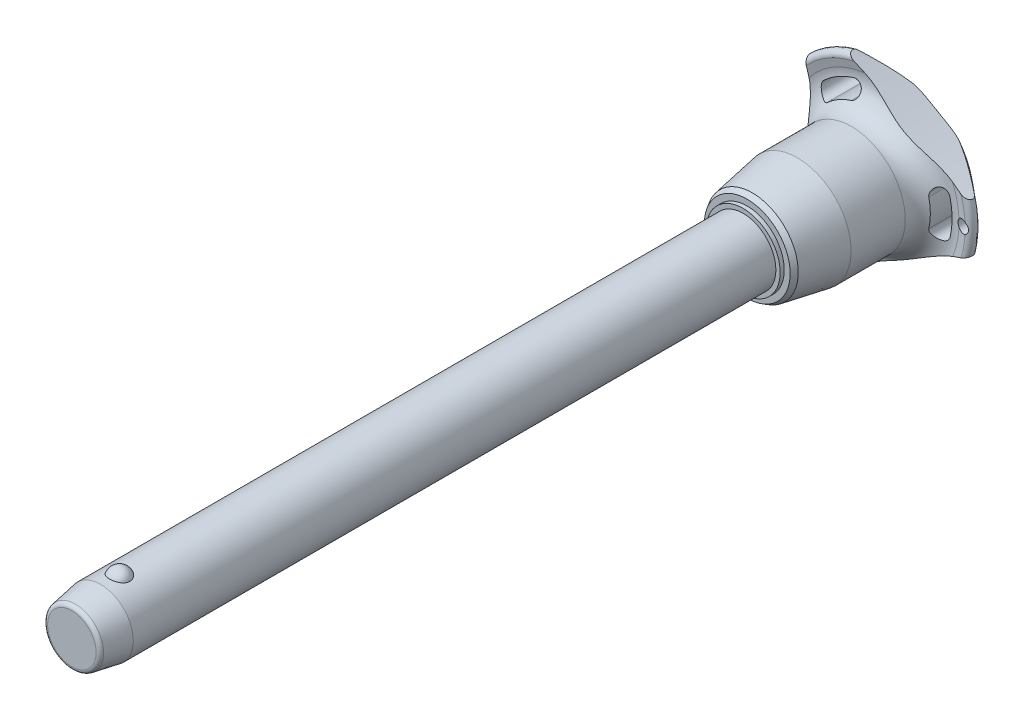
from build123d import *

# Parameters (mm, degrees)
SKETCH1_R           = 8
BOSS_EXTRUDE1_DEPTH = 150
SKETCH2_R           = 7
BOSS_EXTRUDE2_DEPTH = 39.7
BOSS_EXTRUDE3_START = 14
SKETCH1_2_R         = 8
BOSS_EXTRUDE3_DEPTH = 14
CHAMFER1_SIZE       = 7
CHAMFER1_SIZE2      = 1.234288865
FILLET1_R           = 1
SKETCH6_R           = 144.275
CUT_EXTRUDE1_DEPTH  = 193.665775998
CIRPATTERN1_COUNT   = 3
SKETCH7_R           = 1.5
CUT_EXTRUDE2_DEPTH  = 193.561583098


with BuildPart() as part:
    # Sketch1 → Boss-Extrude1 (new body)
    with BuildSketch(Plane.XY):
        Circle(SKETCH1_R)
    extrude(amount=-BOSS_EXTRUDE1_DEPTH)

    # Sketch2 → Boss-Extrude2 (add)
    with BuildSketch(Plane(origin=(0, 0, -150), x_dir=(-1, 0, 0), z_dir=(0, 0, -1))):
        Circle(SKETCH2_R)
    extrude(amount=BOSS_EXTRUDE2_DEPTH)

    # Sketch3 → Revolve1 (revolve)
    with BuildSketch(Plane(origin=(0, 0, 0), x_dir=(0, 0, -1), z_dir=(1, 0, 0))):
        with BuildLine():
            Line((-2.387467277, 9.5), (-2.387467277, 4.2))
            ThreePointArc((-2.387467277, 4.2), (0.262532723, 6.85), (-2.387467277, 9.5))
        make_face()
        with BuildLine():
            Line((-2.387467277, -4.2), (-2.387467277, -9.5))
            ThreePointArc((-2.387467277, -9.5), (0.262532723, -6.85), (-2.387467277, -4.2))
        make_face()
    revolve(axis=Axis((0, -4.2, 2.387467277), (0, 1, 0)))

    # Sketch1_2 → Boss-Extrude3 (add)
    with BuildSketch(Plane.XY.offset(BOSS_EXTRUDE3_START)):
        Circle(SKETCH1_2_R)
    extrude(amount=-BOSS_EXTRUDE3_DEPTH)

    # Chamfer1
    chamfer1_edges = [part.edges().sort_by_distance(p)[0] for p in [
        (-8, 0, 14),
    ]]
    chamfer1_side = [part.faces().sort_by_distance(p)[0] for p in [
        (-8, 0, -68),
    ]]
    chamfer(chamfer1_edges, length=CHAMFER1_SIZE, length2=CHAMFER1_SIZE2, reference=chamfer1_side[0])

    # Fillet1
    fillet1_edges = [part.edges().sort_by_distance(p)[0] for p in [
        (-6.765711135, 0, 14),
        (7, 0, -189.7),
    ]]
    fillet(fillet1_edges, radius=FILLET1_R)

    # Sketch4 → Revolve2 (revolve)
    with BuildSketch(Plane(origin=(0, 0, 0), x_dir=(0, 0, -1), z_dir=(1, 0, 0)), mode=Mode.PRIVATE) as revolve2_sk:
        Polygon((150, 0), (150, 9.044607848), (151, 9.044607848), (151, 10.490707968), (152.25235944, 11.213758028), (163.233333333, 13.15), (176.466666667, 13.15), (176.466666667, 0), align=None)
    revolve(revolve2_sk.sketch.rotate(Axis((0, 0, -176.466666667), (0, 0, 1)), 90), axis=Axis((0, 0, -176.466666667), (0, 0, 1)))

    # Sketch5 → Revolve3 (revolve)
    with BuildSketch(Plane(origin=(0, 0, 0), x_dir=(0, 0, -1), z_dir=(1, 0, 0)), mode=Mode.PRIVATE) as revolve3_sk:
        with BuildLine():
            Line((182.32877039, 20.428960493), (181.910912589, 22.344207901))
            ThreePointArc((181.910912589, 22.344207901), (182.554394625, 23.677136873), (184.002586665, 23.371345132))
            Line((184.002586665, 23.371345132), (189.141488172, 17.247040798))
            ThreePointArc((189.141488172, 17.247040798), (189.7, 15.584758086), (188.978803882, 13.986322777))
            ThreePointArc((188.978803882, 13.986322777), (184.617427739, 7.589034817), (183.083333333, 0))
            Line((183.083333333, 0), (176.466666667, 0))
            Line((176.466666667, 0), (176.466666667, 13.15))
            ThreePointArc((176.466666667, 13.15), (181.139661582, 15.38660811), (182.32877039, 20.428960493))
        make_face()
    revolve(revolve3_sk.sketch.rotate(Axis((0, 0, -183.083333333), (0, 0, 1)), 90), axis=Axis((0, 0, -183.083333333), (0, 0, 1)))

    # Sketch6 → Cut-Extrude1 (cut, through all)
    with BuildSketch(Plane.XY):
        with Locations((-159.975, 0)):
            Circle(SKETCH6_R)
        with BuildLine():
            ThreePointArc((18.131206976, -4.190753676), (18.60922037, 0), (18.131206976, 4.190753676))
            ThreePointArc((18.131206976, 4.190753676), (15.94840906, 5.553949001), (14.585213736, 3.371151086))
            ThreePointArc((14.585213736, 3.371151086), (14.969740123, 0), (14.585213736, -3.371151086))
            ThreePointArc((14.585213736, -3.371151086), (15.94840906, -5.553949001), (18.131206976, -4.190753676))
        make_face()
    cut_extrude1 = extrude(amount=-CUT_EXTRUDE1_DEPTH, mode=Mode.SUBTRACT)

    # CirPattern1: Cut-Extrude1 ×3 about axis
    cirpattern1_axis = Axis((0, 0, 0), (0, 0, 1))
    for i in range(1, CIRPATTERN1_COUNT):
        add(cut_extrude1.rotate(cirpattern1_axis, i * 360 / CIRPATTERN1_COUNT), mode=Mode.SUBTRACT)

    # Sketch7 → Cut-Extrude2 (cut, through all)
    with BuildSketch(Plane.XY):
        with Locations(Location((21.60922037, 0, 0), (0, 0, 297.620773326))):
            Circle(SKETCH7_R)
    extrude(amount=-CUT_EXTRUDE2_DEPTH, mode=Mode.SUBTRACT)


solid = part.part
